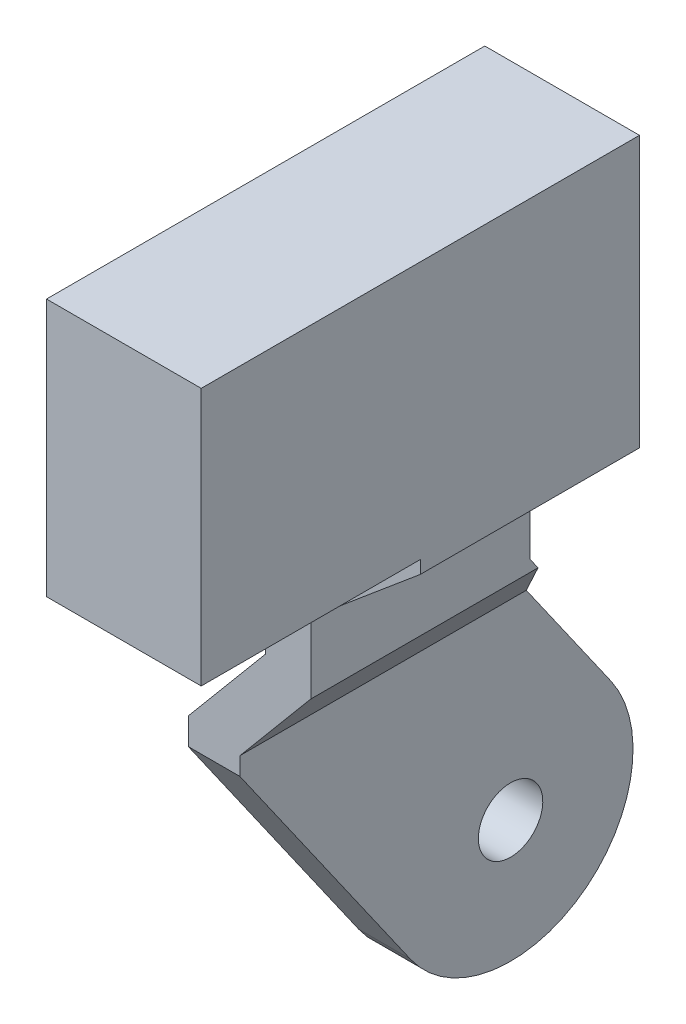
ISO-10303-21;
HEADER;
FILE_DESCRIPTION(('STEP AP214'),'2;1');
FILE_NAME('part.step','',(''),(''),'','','');
FILE_SCHEMA(('AUTOMOTIVE_DESIGN { 1 0 10303 214 1 1 1 1 }'));
ENDSEC;
DATA;
#1=APPLICATION_CONTEXT('core data for automotive mechanical design processes');
#2=APPLICATION_PROTOCOL_DEFINITION('international standard','automotive_design',2000,#1);
#3=PRODUCT_CONTEXT('',#1,'mechanical');
#4=PRODUCT('Part','Part','',(#3));
#5=PRODUCT_RELATED_PRODUCT_CATEGORY('part','',(#4));
#6=PRODUCT_DEFINITION_FORMATION('','',#4);
#7=PRODUCT_DEFINITION_CONTEXT('part definition',#1,'design');
#8=PRODUCT_DEFINITION('design','',#6,#7);
#9=PRODUCT_DEFINITION_SHAPE('','',#8);
#10=(LENGTH_UNIT() NAMED_UNIT(*) SI_UNIT(.MILLI.,.METRE.));
#11=(NAMED_UNIT(*) PLANE_ANGLE_UNIT() SI_UNIT($,.RADIAN.));
#12=(NAMED_UNIT(*) SI_UNIT($,.STERADIAN.) SOLID_ANGLE_UNIT());
#13=UNCERTAINTY_MEASURE_WITH_UNIT(LENGTH_MEASURE(1.E-05),#10,'distance_accuracy_value','');
#14=(GEOMETRIC_REPRESENTATION_CONTEXT(3) GLOBAL_UNCERTAINTY_ASSIGNED_CONTEXT((#13)) GLOBAL_UNIT_ASSIGNED_CONTEXT((#10,
#11,#12)) REPRESENTATION_CONTEXT('',''));
#15=CARTESIAN_POINT('',(0.,0.,0.));
#16=DIRECTION('',(0.,0.,1.));
#17=DIRECTION('',(1.,0.,0.));
#18=AXIS2_PLACEMENT_3D('',#15,#16,#17);
#19=CARTESIAN_POINT('',(20.,226.505215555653,-225.));
#20=DIRECTION('',(-1.,0.,0.));
#21=DIRECTION('',(0.,0.,1.));
#22=AXIS2_PLACEMENT_3D('',#19,#20,#21);
#23=PLANE('',#22);
#24=DIRECTION('',(0.,-1.,0.));
#25=VECTOR('',#24,1.);
#26=CARTESIAN_POINT('',(20.,350.,210.));
#27=LINE('',#26,#25);
#28=CARTESIAN_POINT('',(20.,350.,210.));
#29=VERTEX_POINT('',#28);
#30=CARTESIAN_POINT('',(20.,226.505215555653,210.));
#31=VERTEX_POINT('',#30);
#32=EDGE_CURVE('E52',#29,#31,#27,.T.);
#33=ORIENTED_EDGE('',*,*,#32,.F.);
#34=DIRECTION('',(0.,0.,-1.));
#35=VECTOR('',#34,1.);
#36=CARTESIAN_POINT('',(20.,350.,380.));
#37=LINE('',#36,#35);
#38=CARTESIAN_POINT('',(20.,350.,380.));
#39=VERTEX_POINT('',#38);
#40=EDGE_CURVE('E60',#39,#29,#37,.T.);
#41=ORIENTED_EDGE('',*,*,#40,.F.);
#42=DIRECTION('',(0.,-1.,0.));
#43=VECTOR('',#42,1.);
#44=CARTESIAN_POINT('',(20.,550.,380.));
#45=LINE('',#44,#43);
#46=CARTESIAN_POINT('',(20.,550.,380.));
#47=VERTEX_POINT('',#46);
#48=EDGE_CURVE('E314',#47,#39,#45,.T.);
#49=ORIENTED_EDGE('',*,*,#48,.F.);
#50=DIRECTION('',(0.,0.,1.));
#51=VECTOR('',#50,1.);
#52=CARTESIAN_POINT('',(20.,550.,-225.));
#53=LINE('',#52,#51);
#54=CARTESIAN_POINT('',(20.,550.,40.));
#55=VERTEX_POINT('',#54);
#56=EDGE_CURVE('E330',#55,#47,#53,.T.);
#57=ORIENTED_EDGE('',*,*,#56,.F.);
#58=DIRECTION('',(0.,1.,0.));
#59=VECTOR('',#58,1.);
#60=CARTESIAN_POINT('',(20.,222.753365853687,40.));
#61=LINE('',#60,#59);
#62=CARTESIAN_POINT('',(20.,226.505215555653,40.));
#63=VERTEX_POINT('',#62);
#64=EDGE_CURVE('E12',#63,#55,#61,.T.);
#65=ORIENTED_EDGE('',*,*,#64,.F.);
#66=DIRECTION('',(0.,0.,1.));
#67=VECTOR('',#66,1.);
#68=CARTESIAN_POINT('',(20.,226.505215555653,-225.));
#69=LINE('',#68,#67);
#70=EDGE_CURVE('E328',#63,#31,#69,.T.);
#71=ORIENTED_EDGE('',*,*,#70,.T.);
#72=EDGE_LOOP('',(#33,#41,#49,#57,#65,#71));
#73=FACE_BOUND('',#72,.T.);
#74=CARTESIAN_POINT('',(20.,260.,145.000000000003));
#75=DIRECTION('',(-1.,0.,0.));
#76=DIRECTION('',(0.,0.,1.));
#77=AXIS2_PLACEMENT_3D('',#74,#75,#76);
#78=CIRCLE('',#77,10.);
#79=CARTESIAN_POINT('',(20.,260.,155.000000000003));
#80=VERTEX_POINT('',#79);
#81=EDGE_CURVE('E39',#80,#80,#78,.T.);
#82=ORIENTED_EDGE('',*,*,#81,.F.);
#83=EDGE_LOOP('',(#82));
#84=FACE_BOUND('',#83,.T.);
#85=ADVANCED_FACE('F35',(#73,#84),#23,.T.);
#86=CARTESIAN_POINT('',(-40.,0.,0.));
#87=DIRECTION('',(1.,0.,0.));
#88=DIRECTION('',(0.,0.,-1.));
#89=AXIS2_PLACEMENT_3D('',#86,#87,#88);
#90=CYLINDRICAL_SURFACE('',#89,95.);
#91=DIRECTION('',(1.,0.,0.));
#92=VECTOR('',#91,1.);
#93=CARTESIAN_POINT('',(-40.,54.4897614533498,-77.8194442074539));
#94=LINE('',#93,#92);
#95=CARTESIAN_POINT('',(-40.,54.4897614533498,-77.8194442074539));
#96=VERTEX_POINT('',#95);
#97=CARTESIAN_POINT('',(0.,54.4897614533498,-77.8194442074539));
#98=VERTEX_POINT('',#97);
#99=EDGE_CURVE('E181',#96,#98,#94,.T.);
#100=ORIENTED_EDGE('',*,*,#99,.T.);
#101=CARTESIAN_POINT('',(0.,0.,0.));
#102=DIRECTION('',(1.,0.,0.));
#103=DIRECTION('',(0.,1.,0.));
#104=AXIS2_PLACEMENT_3D('',#101,#102,#103);
#105=CIRCLE('',#104,95.);
#106=CARTESIAN_POINT('',(0.,-54.4897614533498,77.8194442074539));
#107=VERTEX_POINT('',#106);
#108=EDGE_CURVE('E299',#98,#107,#105,.F.);
#109=ORIENTED_EDGE('',*,*,#108,.T.);
#110=DIRECTION('',(1.,0.,0.));
#111=VECTOR('',#110,1.);
#112=CARTESIAN_POINT('',(-40.,-54.4897614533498,77.8194442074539));
#113=LINE('',#112,#111);
#114=CARTESIAN_POINT('',(-40.,-54.4897614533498,77.8194442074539));
#115=VERTEX_POINT('',#114);
#116=EDGE_CURVE('E151',#115,#107,#113,.T.);
#117=ORIENTED_EDGE('',*,*,#116,.F.);
#118=CARTESIAN_POINT('',(-40.,0.,0.));
#119=DIRECTION('',(1.,0.,0.));
#120=DIRECTION('',(0.,0.,-1.));
#121=AXIS2_PLACEMENT_3D('',#118,#119,#120);
#122=CIRCLE('',#121,95.);
#123=EDGE_CURVE('E166',#115,#96,#122,.T.);
#124=ORIENTED_EDGE('',*,*,#123,.T.);
#125=EDGE_LOOP('',(#100,#109,#117,#124));
#126=FACE_BOUND('',#125,.T.);
#127=ADVANCED_FACE('F226',(#126),#90,.T.);
#128=CARTESIAN_POINT('',(-40.,134.283635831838,210.));
#129=DIRECTION('',(0.,-0.57357643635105,0.819152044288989));
#130=DIRECTION('',(0.,-0.819152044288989,-0.57357643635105));
#131=AXIS2_PLACEMENT_3D('',#128,#129,#130);
#132=PLANE('',#131);
#133=ORIENTED_EDGE('',*,*,#116,.T.);
#134=DIRECTION('',(0.,0.819152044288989,0.57357643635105));
#135=VECTOR('',#134,1.);
#136=CARTESIAN_POINT('',(0.,134.283635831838,210.));
#137=LINE('',#136,#135);
#138=CARTESIAN_POINT('',(0.,134.283635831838,210.));
#139=VERTEX_POINT('',#138);
#140=EDGE_CURVE('E302',#107,#139,#137,.T.);
#141=ORIENTED_EDGE('',*,*,#140,.T.);
#142=DIRECTION('',(1.,0.,0.));
#143=VECTOR('',#142,1.);
#144=CARTESIAN_POINT('',(-40.,134.283635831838,210.));
#145=LINE('',#144,#143);
#146=CARTESIAN_POINT('',(-40.,134.283635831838,210.));
#147=VERTEX_POINT('',#146);
#148=EDGE_CURVE('E184',#147,#139,#145,.T.);
#149=ORIENTED_EDGE('',*,*,#148,.F.);
#150=DIRECTION('',(0.,-0.819152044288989,-0.57357643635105));
#151=VECTOR('',#150,1.);
#152=CARTESIAN_POINT('',(-40.,134.283635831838,210.));
#153=LINE('',#152,#151);
#154=EDGE_CURVE('E178',#147,#115,#153,.T.);
#155=ORIENTED_EDGE('',*,*,#154,.T.);
#156=EDGE_LOOP('',(#133,#141,#149,#155));
#157=FACE_BOUND('',#156,.T.);
#158=ADVANCED_FACE('F232',(#157),#132,.T.);
#159=CARTESIAN_POINT('',(-40.,350.,210.));
#160=DIRECTION('',(0.,0.,1.));
#161=DIRECTION('',(0.,-1.,0.));
#162=AXIS2_PLACEMENT_3D('',#159,#160,#161);
#163=PLANE('',#162);
#164=ORIENTED_EDGE('',*,*,#32,.T.);
#165=DIRECTION('',(-0.642787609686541,-0.766044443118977,0.));
#166=VECTOR('',#165,1.);
#167=CARTESIAN_POINT('',(56.0187559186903,269.430697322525,210.));
#168=LINE('',#167,#166);
#169=CARTESIAN_POINT('',(-40.,155.,210.));
#170=VERTEX_POINT('',#169);
#171=EDGE_CURVE('E294',#31,#170,#168,.T.);
#172=ORIENTED_EDGE('',*,*,#171,.T.);
#173=DIRECTION('',(0.,-1.,0.));
#174=VECTOR('',#173,1.);
#175=CARTESIAN_POINT('',(-40.,350.,210.));
#176=LINE('',#175,#174);
#177=EDGE_CURVE('E176',#170,#147,#176,.T.);
#178=ORIENTED_EDGE('',*,*,#177,.T.);
#179=ORIENTED_EDGE('',*,*,#148,.T.);
#180=DIRECTION('',(0.,1.,0.));
#181=VECTOR('',#180,1.);
#182=CARTESIAN_POINT('',(0.,350.,210.));
#183=LINE('',#182,#181);
#184=CARTESIAN_POINT('',(0.,148.219809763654,210.));
#185=VERTEX_POINT('',#184);
#186=EDGE_CURVE('E305',#139,#185,#183,.T.);
#187=ORIENTED_EDGE('',*,*,#186,.T.);
#188=DIRECTION('',(0.64278760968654,0.766044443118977,0.));
#189=VECTOR('',#188,1.);
#190=CARTESIAN_POINT('',(82.8303114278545,246.933130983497,210.));
#191=LINE('',#190,#189);
#192=CARTESIAN_POINT('',(55.,213.766257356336,210.));
#193=VERTEX_POINT('',#192);
#194=EDGE_CURVE('E308',#185,#193,#191,.T.);
#195=ORIENTED_EDGE('',*,*,#194,.T.);
#196=DIRECTION('',(0.,1.,0.));
#197=VECTOR('',#196,1.);
#198=CARTESIAN_POINT('',(55.,350.,210.));
#199=LINE('',#198,#197);
#200=CARTESIAN_POINT('',(55.,268.676531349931,210.));
#201=VERTEX_POINT('',#200);
#202=EDGE_CURVE('E158',#193,#201,#199,.T.);
#203=ORIENTED_EDGE('',*,*,#202,.T.);
#204=DIRECTION('',(0.76604444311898,0.642787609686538,0.));
#205=VECTOR('',#204,1.);
#206=CARTESIAN_POINT('',(39.295702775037,255.499061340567,210.));
#207=LINE('',#206,#205);
#208=CARTESIAN_POINT('',(140.,340.,210.));
#209=VERTEX_POINT('',#208);
#210=EDGE_CURVE('E142',#201,#209,#207,.T.);
#211=ORIENTED_EDGE('',*,*,#210,.T.);
#212=DIRECTION('',(0.,-1.,0.));
#213=VECTOR('',#212,1.);
#214=CARTESIAN_POINT('',(140.,350.,210.));
#215=LINE('',#214,#213);
#216=CARTESIAN_POINT('',(140.,350.,210.));
#217=VERTEX_POINT('',#216);
#218=EDGE_CURVE('E156',#217,#209,#215,.T.);
#219=ORIENTED_EDGE('',*,*,#218,.F.);
#220=DIRECTION('',(1.,0.,0.));
#221=VECTOR('',#220,1.);
#222=CARTESIAN_POINT('',(-40.,350.,210.));
#223=LINE('',#222,#221);
#224=EDGE_CURVE('E187',#29,#217,#223,.T.);
#225=ORIENTED_EDGE('',*,*,#224,.F.);
#226=EDGE_LOOP('',(#164,#172,#178,#179,#187,#195,#203,#211,#219,#225));
#227=FACE_BOUND('',#226,.T.);
#228=ADVANCED_FACE('F155',(#227),#163,.T.);
#229=CARTESIAN_POINT('',(-40.,350.,380.));
#230=DIRECTION('',(0.,-1.,0.));
#231=DIRECTION('',(0.,0.,-1.));
#232=AXIS2_PLACEMENT_3D('',#229,#230,#231);
#233=PLANE('',#232);
#234=DIRECTION('',(1.,0.,0.));
#235=VECTOR('',#234,1.);
#236=CARTESIAN_POINT('',(-40.,350.,380.));
#237=LINE('',#236,#235);
#238=CARTESIAN_POINT('',(140.,350.,380.));
#239=VERTEX_POINT('',#238);
#240=EDGE_CURVE('E189',#39,#239,#237,.T.);
#241=ORIENTED_EDGE('',*,*,#240,.F.);
#242=ORIENTED_EDGE('',*,*,#40,.T.);
#243=ORIENTED_EDGE('',*,*,#224,.T.);
#244=DIRECTION('',(0.,0.,-1.));
#245=VECTOR('',#244,1.);
#246=CARTESIAN_POINT('',(140.,350.,380.));
#247=LINE('',#246,#245);
#248=EDGE_CURVE('E165',#239,#217,#247,.T.);
#249=ORIENTED_EDGE('',*,*,#248,.F.);
#250=EDGE_LOOP('',(#241,#242,#243,#249));
#251=FACE_BOUND('',#250,.T.);
#252=ADVANCED_FACE('F264',(#251),#233,.T.);
#253=CARTESIAN_POINT('',(-40.,550.,380.));
#254=DIRECTION('',(0.,0.,1.));
#255=DIRECTION('',(0.,-1.,0.));
#256=AXIS2_PLACEMENT_3D('',#253,#254,#255);
#257=PLANE('',#256);
#258=DIRECTION('',(1.,0.,0.));
#259=VECTOR('',#258,1.);
#260=CARTESIAN_POINT('',(-40.,550.,380.));
#261=LINE('',#260,#259);
#262=CARTESIAN_POINT('',(140.,550.,380.));
#263=VERTEX_POINT('',#262);
#264=EDGE_CURVE('E191',#47,#263,#261,.T.);
#265=ORIENTED_EDGE('',*,*,#264,.F.);
#266=ORIENTED_EDGE('',*,*,#48,.T.);
#267=ORIENTED_EDGE('',*,*,#240,.T.);
#268=DIRECTION('',(0.,-1.,0.));
#269=VECTOR('',#268,1.);
#270=CARTESIAN_POINT('',(140.,550.,380.));
#271=LINE('',#270,#269);
#272=EDGE_CURVE('E170',#263,#239,#271,.T.);
#273=ORIENTED_EDGE('',*,*,#272,.F.);
#274=EDGE_LOOP('',(#265,#266,#267,#273));
#275=FACE_BOUND('',#274,.T.);
#276=ADVANCED_FACE('F267',(#275),#257,.T.);
#277=CARTESIAN_POINT('',(-40.,550.,40.));
#278=DIRECTION('',(0.,1.,0.));
#279=DIRECTION('',(0.,0.,1.));
#280=AXIS2_PLACEMENT_3D('',#277,#278,#279);
#281=PLANE('',#280);
#282=DIRECTION('',(1.,0.,0.));
#283=VECTOR('',#282,1.);
#284=CARTESIAN_POINT('',(-40.,550.,40.));
#285=LINE('',#284,#283);
#286=CARTESIAN_POINT('',(140.,550.,40.));
#287=VERTEX_POINT('',#286);
#288=EDGE_CURVE('E193',#55,#287,#285,.T.);
#289=ORIENTED_EDGE('',*,*,#288,.F.);
#290=ORIENTED_EDGE('',*,*,#56,.T.);
#291=ORIENTED_EDGE('',*,*,#264,.T.);
#292=DIRECTION('',(0.,0.,1.));
#293=VECTOR('',#292,1.);
#294=CARTESIAN_POINT('',(140.,550.,40.));
#295=LINE('',#294,#293);
#296=EDGE_CURVE('E320',#287,#263,#295,.T.);
#297=ORIENTED_EDGE('',*,*,#296,.F.);
#298=EDGE_LOOP('',(#289,#290,#291,#297));
#299=FACE_BOUND('',#298,.T.);
#300=ADVANCED_FACE('F270',(#299),#281,.T.);
#301=CARTESIAN_POINT('',(-40.,222.753365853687,40.));
#302=DIRECTION('',(0.,0.,-1.));
#303=DIRECTION('',(-1.,0.,0.));
#304=AXIS2_PLACEMENT_3D('',#301,#302,#303);
#305=PLANE('',#304);
#306=DIRECTION('',(1.,0.,0.));
#307=VECTOR('',#306,1.);
#308=CARTESIAN_POINT('',(-40.,222.753365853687,40.));
#309=LINE('',#308,#307);
#310=CARTESIAN_POINT('',(16.8518242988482,222.753365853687,40.));
#311=VERTEX_POINT('',#310);
#312=CARTESIAN_POINT('',(55.,222.753365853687,40.));
#313=VERTEX_POINT('',#312);
#314=EDGE_CURVE('E195',#311,#313,#309,.T.);
#315=ORIENTED_EDGE('',*,*,#314,.F.);
#316=DIRECTION('',(0.642787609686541,0.766044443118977,0.));
#317=VECTOR('',#316,1.);
#318=CARTESIAN_POINT('',(-6.63798000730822,194.75930718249,40.));
#319=LINE('',#318,#317);
#320=EDGE_CURVE('E292',#311,#63,#319,.T.);
#321=ORIENTED_EDGE('',*,*,#320,.T.);
#322=ORIENTED_EDGE('',*,*,#64,.T.);
#323=ORIENTED_EDGE('',*,*,#288,.T.);
#324=DIRECTION('',(0.,1.,0.));
#325=VECTOR('',#324,1.);
#326=CARTESIAN_POINT('',(140.,222.753365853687,40.));
#327=LINE('',#326,#325);
#328=CARTESIAN_POINT('',(140.,340.,40.));
#329=VERTEX_POINT('',#328);
#330=EDGE_CURVE('E318',#329,#287,#327,.T.);
#331=ORIENTED_EDGE('',*,*,#330,.F.);
#332=DIRECTION('',(-0.76604444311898,-0.642787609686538,0.));
#333=VECTOR('',#332,1.);
#334=CARTESIAN_POINT('',(-23.3610331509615,202.923817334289,40.));
#335=LINE('',#334,#333);
#336=CARTESIAN_POINT('',(55.,268.676531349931,40.));
#337=VERTEX_POINT('',#336);
#338=EDGE_CURVE('E145',#329,#337,#335,.T.);
#339=ORIENTED_EDGE('',*,*,#338,.T.);
#340=DIRECTION('',(0.,-1.,0.));
#341=VECTOR('',#340,1.);
#342=CARTESIAN_POINT('',(55.,222.753365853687,40.));
#343=LINE('',#342,#341);
#344=EDGE_CURVE('E310',#337,#313,#343,.T.);
#345=ORIENTED_EDGE('',*,*,#344,.T.);
#346=EDGE_LOOP('',(#315,#321,#322,#323,#331,#339,#345));
#347=FACE_BOUND('',#346,.T.);
#348=ADVANCED_FACE('F274',(#347),#305,.T.);
#349=CARTESIAN_POINT('',(-40.,54.4897614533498,-77.8194442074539));
#350=DIRECTION('',(0.,0.57357643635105,-0.819152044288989));
#351=DIRECTION('',(0.,0.819152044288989,0.57357643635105));
#352=AXIS2_PLACEMENT_3D('',#349,#350,#351);
#353=PLANE('',#352);
#354=DIRECTION('',(0.,0.819152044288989,0.57357643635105));
#355=VECTOR('',#354,1.);
#356=CARTESIAN_POINT('',(-40.,54.4897614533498,-77.8194442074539));
#357=LINE('',#356,#355);
#358=CARTESIAN_POINT('',(-40.,155.,-7.44141750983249));
#359=VERTEX_POINT('',#358);
#360=EDGE_CURVE('E168',#96,#359,#357,.T.);
#361=ORIENTED_EDGE('',*,*,#360,.T.);
#362=DIRECTION('',(0.566444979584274,0.67506283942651,0.472684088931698));
#363=VECTOR('',#362,1.);
#364=CARTESIAN_POINT('',(-97.2773871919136,86.7394680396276,-55.2379565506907));
#365=LINE('',#364,#363);
#366=EDGE_CURVE('E159',#359,#311,#365,.T.);
#367=ORIENTED_EDGE('',*,*,#366,.T.);
#368=ORIENTED_EDGE('',*,*,#314,.T.);
#369=DIRECTION('',(0.,-0.819152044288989,-0.57357643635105));
#370=VECTOR('',#369,1.);
#371=CARTESIAN_POINT('',(55.,54.4897614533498,-77.8194442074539));
#372=LINE('',#371,#370);
#373=CARTESIAN_POINT('',(55.,213.766257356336,33.7071588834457));
#374=VERTEX_POINT('',#373);
#375=EDGE_CURVE('E44',#313,#374,#372,.T.);
#376=ORIENTED_EDGE('',*,*,#375,.T.);
#377=DIRECTION('',(-0.566444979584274,-0.67506283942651,-0.472684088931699));
#378=VECTOR('',#377,1.);
#379=CARTESIAN_POINT('',(-66.2479825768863,69.2685385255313,-67.4712330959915));
#380=LINE('',#379,#378);
#381=CARTESIAN_POINT('',(0.,148.219809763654,-12.188957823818));
#382=VERTEX_POINT('',#381);
#383=EDGE_CURVE('E205',#374,#382,#380,.T.);
#384=ORIENTED_EDGE('',*,*,#383,.T.);
#385=DIRECTION('',(0.,-0.819152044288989,-0.57357643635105));
#386=VECTOR('',#385,1.);
#387=CARTESIAN_POINT('',(0.,54.4897614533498,-77.8194442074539));
#388=LINE('',#387,#386);
#389=EDGE_CURVE('E202',#382,#98,#388,.T.);
#390=ORIENTED_EDGE('',*,*,#389,.T.);
#391=ORIENTED_EDGE('',*,*,#99,.F.);
#392=EDGE_LOOP('',(#361,#367,#368,#376,#384,#390,#391));
#393=FACE_BOUND('',#392,.T.);
#394=ADVANCED_FACE('F257',(#393),#353,.T.);
#395=CARTESIAN_POINT('',(-40.,0.,0.));
#396=DIRECTION('',(1.,0.,0.));
#397=DIRECTION('',(0.,0.,-1.));
#398=AXIS2_PLACEMENT_3D('',#395,#396,#397);
#399=PLANE('',#398);
#400=CARTESIAN_POINT('',(-40.,0.,0.));
#401=DIRECTION('',(-1.,0.,0.));
#402=DIRECTION('',(0.,0.,1.));
#403=AXIS2_PLACEMENT_3D('',#400,#401,#402);
#404=CIRCLE('',#403,25.);
#405=CARTESIAN_POINT('',(-40.,0.,25.));
#406=VERTEX_POINT('',#405);
#407=EDGE_CURVE('E212',#406,#406,#404,.T.);
#408=ORIENTED_EDGE('',*,*,#407,.F.);
#409=EDGE_LOOP('',(#408));
#410=FACE_BOUND('',#409,.T.);
#411=DIRECTION('',(0.,0.,1.));
#412=VECTOR('',#411,1.);
#413=CARTESIAN_POINT('',(-40.,155.,0.));
#414=LINE('',#413,#412);
#415=EDGE_CURVE('E150',#359,#170,#414,.T.);
#416=ORIENTED_EDGE('',*,*,#415,.F.);
#417=ORIENTED_EDGE('',*,*,#360,.F.);
#418=ORIENTED_EDGE('',*,*,#123,.F.);
#419=ORIENTED_EDGE('',*,*,#154,.F.);
#420=ORIENTED_EDGE('',*,*,#177,.F.);
#421=EDGE_LOOP('',(#416,#417,#418,#419,#420));
#422=FACE_BOUND('',#421,.T.);
#423=ADVANCED_FACE('F254',(#410,#422),#399,.F.);
#424=CARTESIAN_POINT('',(140.,0.,0.));
#425=DIRECTION('',(1.,0.,0.));
#426=DIRECTION('',(0.,0.,-1.));
#427=AXIS2_PLACEMENT_3D('',#424,#425,#426);
#428=PLANE('',#427);
#429=ORIENTED_EDGE('',*,*,#218,.T.);
#430=DIRECTION('',(0.,0.,-1.));
#431=VECTOR('',#430,1.);
#432=CARTESIAN_POINT('',(140.,340.,0.));
#433=LINE('',#432,#431);
#434=EDGE_CURVE('E138',#209,#329,#433,.T.);
#435=ORIENTED_EDGE('',*,*,#434,.T.);
#436=ORIENTED_EDGE('',*,*,#330,.T.);
#437=ORIENTED_EDGE('',*,*,#296,.T.);
#438=ORIENTED_EDGE('',*,*,#272,.T.);
#439=ORIENTED_EDGE('',*,*,#248,.T.);
#440=EDGE_LOOP('',(#429,#435,#436,#437,#438,#439));
#441=FACE_BOUND('',#440,.T.);
#442=ADVANCED_FACE('F162',(#441),#428,.T.);
#443=CARTESIAN_POINT('',(55.,268.676531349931,-225.));
#444=DIRECTION('',(0.642787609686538,-0.76604444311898,0.));
#445=DIRECTION('',(0.76604444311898,0.642787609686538,0.));
#446=AXIS2_PLACEMENT_3D('',#443,#444,#445);
#447=PLANE('',#446);
#448=ORIENTED_EDGE('',*,*,#210,.F.);
#449=DIRECTION('',(0.,0.,1.));
#450=VECTOR('',#449,1.);
#451=CARTESIAN_POINT('',(55.,268.676531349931,-225.));
#452=LINE('',#451,#450);
#453=EDGE_CURVE('E332',#337,#201,#452,.T.);
#454=ORIENTED_EDGE('',*,*,#453,.F.);
#455=ORIENTED_EDGE('',*,*,#338,.F.);
#456=ORIENTED_EDGE('',*,*,#434,.F.);
#457=EDGE_LOOP('',(#448,#454,#455,#456));
#458=FACE_BOUND('',#457,.T.);
#459=ADVANCED_FACE('F140',(#458),#447,.T.);
#460=CARTESIAN_POINT('',(0.,-95.,-225.));
#461=DIRECTION('',(1.,0.,0.));
#462=DIRECTION('',(0.,1.,0.));
#463=AXIS2_PLACEMENT_3D('',#460,#461,#462);
#464=PLANE('',#463);
#465=CARTESIAN_POINT('',(0.,0.,0.));
#466=DIRECTION('',(1.,0.,0.));
#467=DIRECTION('',(0.,1.,0.));
#468=AXIS2_PLACEMENT_3D('',#465,#466,#467);
#469=CIRCLE('',#468,25.);
#470=CARTESIAN_POINT('',(0.,25.,0.));
#471=VERTEX_POINT('',#470);
#472=EDGE_CURVE('E210',#471,#471,#469,.T.);
#473=ORIENTED_EDGE('',*,*,#472,.F.);
#474=EDGE_LOOP('',(#473));
#475=FACE_BOUND('',#474,.T.);
#476=ORIENTED_EDGE('',*,*,#186,.F.);
#477=ORIENTED_EDGE('',*,*,#140,.F.);
#478=ORIENTED_EDGE('',*,*,#108,.F.);
#479=ORIENTED_EDGE('',*,*,#389,.F.);
#480=DIRECTION('',(0.,0.,1.));
#481=VECTOR('',#480,1.);
#482=CARTESIAN_POINT('',(0.,148.219809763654,-225.));
#483=LINE('',#482,#481);
#484=EDGE_CURVE('E215',#382,#185,#483,.T.);
#485=ORIENTED_EDGE('',*,*,#484,.T.);
#486=EDGE_LOOP('',(#476,#477,#478,#479,#485));
#487=FACE_BOUND('',#486,.T.);
#488=ADVANCED_FACE('F240',(#475,#487),#464,.T.);
#489=CARTESIAN_POINT('',(0.,148.219809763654,-225.));
#490=DIRECTION('',(0.766044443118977,-0.64278760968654,0.));
#491=DIRECTION('',(0.64278760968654,0.766044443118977,0.));
#492=AXIS2_PLACEMENT_3D('',#489,#490,#491);
#493=PLANE('',#492);
#494=ORIENTED_EDGE('',*,*,#194,.F.);
#495=ORIENTED_EDGE('',*,*,#484,.F.);
#496=ORIENTED_EDGE('',*,*,#383,.F.);
#497=DIRECTION('',(0.,0.,1.));
#498=VECTOR('',#497,1.);
#499=CARTESIAN_POINT('',(55.,213.766257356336,-225.));
#500=LINE('',#499,#498);
#501=EDGE_CURVE('E219',#374,#193,#500,.T.);
#502=ORIENTED_EDGE('',*,*,#501,.T.);
#503=EDGE_LOOP('',(#494,#495,#496,#502));
#504=FACE_BOUND('',#503,.T.);
#505=ADVANCED_FACE('F244',(#504),#493,.T.);
#506=CARTESIAN_POINT('',(55.,213.766257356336,-225.));
#507=DIRECTION('',(1.,0.,0.));
#508=DIRECTION('',(0.,0.,-1.));
#509=AXIS2_PLACEMENT_3D('',#506,#507,#508);
#510=PLANE('',#509);
#511=ORIENTED_EDGE('',*,*,#202,.F.);
#512=ORIENTED_EDGE('',*,*,#501,.F.);
#513=ORIENTED_EDGE('',*,*,#375,.F.);
#514=ORIENTED_EDGE('',*,*,#344,.F.);
#515=ORIENTED_EDGE('',*,*,#453,.T.);
#516=EDGE_LOOP('',(#511,#512,#513,#514,#515));
#517=FACE_BOUND('',#516,.T.);
#518=ADVANCED_FACE('F241',(#517),#510,.T.);
#519=CARTESIAN_POINT('',(20.,226.505215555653,-225.));
#520=DIRECTION('',(-0.766044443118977,0.642787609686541,0.));
#521=DIRECTION('',(-0.642787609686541,-0.766044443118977,0.));
#522=AXIS2_PLACEMENT_3D('',#519,#520,#521);
#523=PLANE('',#522);
#524=ORIENTED_EDGE('',*,*,#171,.F.);
#525=ORIENTED_EDGE('',*,*,#70,.F.);
#526=ORIENTED_EDGE('',*,*,#320,.F.);
#527=ORIENTED_EDGE('',*,*,#366,.F.);
#528=ORIENTED_EDGE('',*,*,#415,.T.);
#529=EDGE_LOOP('',(#524,#525,#526,#527,#528));
#530=FACE_BOUND('',#529,.T.);
#531=ADVANCED_FACE('F236',(#530),#523,.T.);
#532=CARTESIAN_POINT('',(-40.,260.,145.000000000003));
#533=DIRECTION('',(1.,0.,0.));
#534=DIRECTION('',(0.,0.,-1.));
#535=AXIS2_PLACEMENT_3D('',#532,#533,#534);
#536=CYLINDRICAL_SURFACE('',#535,10.);
#537=CARTESIAN_POINT('',(-40.,260.,145.000000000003));
#538=DIRECTION('',(-1.,0.,0.));
#539=DIRECTION('',(0.,0.,1.));
#540=AXIS2_PLACEMENT_3D('',#537,#538,#539);
#541=CIRCLE('',#540,10.);
#542=CARTESIAN_POINT('',(-40.,260.,155.000000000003));
#543=VERTEX_POINT('',#542);
#544=EDGE_CURVE('E213',#543,#543,#541,.T.);
#545=ORIENTED_EDGE('',*,*,#544,.F.);
#546=EDGE_LOOP('',(#545));
#547=FACE_BOUND('',#546,.T.);
#548=ORIENTED_EDGE('',*,*,#81,.T.);
#549=EDGE_LOOP('',(#548));
#550=FACE_BOUND('',#549,.T.);
#551=ADVANCED_FACE('F37',(#547,#550),#536,.T.);
#552=CARTESIAN_POINT('',(-40.,260.,150.000000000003));
#553=DIRECTION('',(-1.,0.,0.));
#554=DIRECTION('',(0.,0.,1.));
#555=AXIS2_PLACEMENT_3D('',#552,#553,#554);
#556=PLANE('',#555);
#557=ORIENTED_EDGE('',*,*,#544,.T.);
#558=EDGE_LOOP('',(#557));
#559=FACE_BOUND('',#558,.T.);
#560=ADVANCED_FACE('F349',(#559),#556,.T.);
#561=CARTESIAN_POINT('',(140.,0.,0.));
#562=DIRECTION('',(-1.,0.,0.));
#563=DIRECTION('',(0.,0.,1.));
#564=AXIS2_PLACEMENT_3D('',#561,#562,#563);
#565=CYLINDRICAL_SURFACE('',#564,25.);
#566=ORIENTED_EDGE('',*,*,#472,.T.);
#567=EDGE_LOOP('',(#566));
#568=FACE_BOUND('',#567,.T.);
#569=ORIENTED_EDGE('',*,*,#407,.T.);
#570=EDGE_LOOP('',(#569));
#571=FACE_BOUND('',#570,.T.);
#572=ADVANCED_FACE('F347',(#568,#571),#565,.F.);
#573=CLOSED_SHELL('',(#85,#127,#158,#228,#252,#276,#300,#348,#394,#423,#442,#459,#488,#505,#518,
#531,#551,#560,#572));
#574=MANIFOLD_SOLID_BREP('B2',#573);
#575=ADVANCED_BREP_SHAPE_REPRESENTATION('',(#18,#574),#14);
#576=SHAPE_DEFINITION_REPRESENTATION(#9,#575);
ENDSEC;
END-ISO-10303-21;
